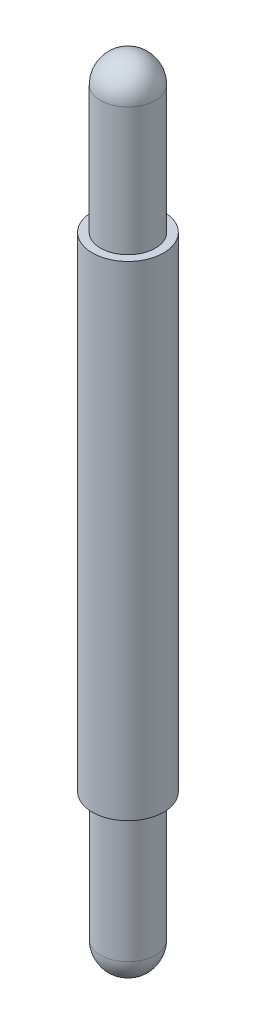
ISO-10303-21;
HEADER;
FILE_DESCRIPTION(('STEP AP214'),'2;1');
FILE_NAME('part.step','',(''),(''),'','','');
FILE_SCHEMA(('AUTOMOTIVE_DESIGN { 1 0 10303 214 1 1 1 1 }'));
ENDSEC;
DATA;
#1=APPLICATION_CONTEXT('core data for automotive mechanical design processes');
#2=APPLICATION_PROTOCOL_DEFINITION('international standard','automotive_design',2000,#1);
#3=PRODUCT_CONTEXT('',#1,'mechanical');
#4=PRODUCT('Part','Part','',(#3));
#5=PRODUCT_RELATED_PRODUCT_CATEGORY('part','',(#4));
#6=PRODUCT_DEFINITION_FORMATION('','',#4);
#7=PRODUCT_DEFINITION_CONTEXT('part definition',#1,'design');
#8=PRODUCT_DEFINITION('design','',#6,#7);
#9=PRODUCT_DEFINITION_SHAPE('','',#8);
#10=(LENGTH_UNIT() NAMED_UNIT(*) SI_UNIT(.MILLI.,.METRE.));
#11=(NAMED_UNIT(*) PLANE_ANGLE_UNIT() SI_UNIT($,.RADIAN.));
#12=(NAMED_UNIT(*) SI_UNIT($,.STERADIAN.) SOLID_ANGLE_UNIT());
#13=UNCERTAINTY_MEASURE_WITH_UNIT(LENGTH_MEASURE(1.E-05),#10,'distance_accuracy_value','');
#14=(GEOMETRIC_REPRESENTATION_CONTEXT(3) GLOBAL_UNCERTAINTY_ASSIGNED_CONTEXT((#13)) GLOBAL_UNIT_ASSIGNED_CONTEXT((#10,
#11,#12)) REPRESENTATION_CONTEXT('',''));
#15=CARTESIAN_POINT('',(0.,0.,0.));
#16=DIRECTION('',(0.,0.,1.));
#17=DIRECTION('',(1.,0.,0.));
#18=AXIS2_PLACEMENT_3D('',#15,#16,#17);
#19=CARTESIAN_POINT('',(0.,29.7499999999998,0.));
#20=DIRECTION('',(0.,1.,0.));
#21=DIRECTION('',(-0.89769110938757,0.,0.440625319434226));
#22=AXIS2_PLACEMENT_3D('',#19,#20,#21);
#23=CYLINDRICAL_SURFACE('',#22,3.);
#24=CARTESIAN_POINT('',(0.,43.7499999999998,0.));
#25=DIRECTION('',(0.,1.,0.));
#26=DIRECTION('',(-0.89769110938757,0.,0.440625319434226));
#27=AXIS2_PLACEMENT_3D('',#24,#25,#26);
#28=CIRCLE('',#27,3.);
#29=CARTESIAN_POINT('',(-2.69307332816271,43.7499999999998,1.32187595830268));
#30=VERTEX_POINT('',#29);
#31=EDGE_CURVE('E9',#30,#30,#28,.F.);
#32=ORIENTED_EDGE('',*,*,#31,.T.);
#33=EDGE_LOOP('',(#32));
#34=FACE_BOUND('',#33,.T.);
#35=CARTESIAN_POINT('',(0.,29.7499999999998,0.));
#36=DIRECTION('',(0.,-1.,0.));
#37=DIRECTION('',(0.89769110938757,0.,-0.440625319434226));
#38=AXIS2_PLACEMENT_3D('',#35,#36,#37);
#39=CIRCLE('',#38,3.);
#40=CARTESIAN_POINT('',(2.69307332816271,29.7499999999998,-1.32187595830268));
#41=VERTEX_POINT('',#40);
#42=EDGE_CURVE('E19',#41,#41,#39,.T.);
#43=ORIENTED_EDGE('',*,*,#42,.F.);
#44=EDGE_LOOP('',(#43));
#45=FACE_BOUND('',#44,.T.);
#46=ADVANCED_FACE('F13',(#34,#45),#23,.T.);
#47=CARTESIAN_POINT('',(0.,43.7499999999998,0.));
#48=DIRECTION('',(0.,-1.,0.));
#49=DIRECTION('',(0.89769110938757,0.,-0.440625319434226));
#50=AXIS2_PLACEMENT_3D('',#47,#48,#49);
#51=SPHERICAL_SURFACE('',#50,3.);
#52=ORIENTED_EDGE('',*,*,#31,.F.);
#53=EDGE_LOOP('',(#52));
#54=FACE_BOUND('',#53,.T.);
#55=ADVANCED_FACE('F44',(#54),#51,.T.);
#56=CARTESIAN_POINT('',(0.,29.7500000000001,0.));
#57=DIRECTION('',(0.,-1.,0.));
#58=DIRECTION('',(0.999589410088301,0.,0.028653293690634));
#59=AXIS2_PLACEMENT_3D('',#56,#57,#58);
#60=PLANE('',#59);
#61=CARTESIAN_POINT('',(0.,29.7500000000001,0.));
#62=DIRECTION('',(0.,-1.,0.));
#63=DIRECTION('',(0.999589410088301,0.,0.028653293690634));
#64=AXIS2_PLACEMENT_3D('',#61,#62,#63);
#65=CIRCLE('',#64,3.9);
#66=CARTESIAN_POINT('',(-3.89839869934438,29.7500000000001,-0.111747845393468));
#67=VERTEX_POINT('',#66);
#68=EDGE_CURVE('E35',#67,#67,#65,.T.);
#69=ORIENTED_EDGE('',*,*,#68,.F.);
#70=EDGE_LOOP('',(#69));
#71=FACE_BOUND('',#70,.T.);
#72=ORIENTED_EDGE('',*,*,#42,.T.);
#73=EDGE_LOOP('',(#72));
#74=FACE_BOUND('',#73,.T.);
#75=ADVANCED_FACE('F41',(#71,#74),#60,.F.);
#76=CARTESIAN_POINT('',(0.,-23.2499999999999,0.));
#77=DIRECTION('',(0.,-1.,0.));
#78=DIRECTION('',(-1.,0.,0.));
#79=AXIS2_PLACEMENT_3D('',#76,#77,#78);
#80=CYLINDRICAL_SURFACE('',#79,3.);
#81=CARTESIAN_POINT('',(0.,-37.2499999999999,0.));
#82=DIRECTION('',(0.,-1.,0.));
#83=DIRECTION('',(-1.,0.,0.));
#84=AXIS2_PLACEMENT_3D('',#81,#82,#83);
#85=CIRCLE('',#84,3.);
#86=CARTESIAN_POINT('',(-3.,-37.2499999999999,0.));
#87=VERTEX_POINT('',#86);
#88=EDGE_CURVE('E23',#87,#87,#85,.F.);
#89=ORIENTED_EDGE('',*,*,#88,.T.);
#90=EDGE_LOOP('',(#89));
#91=FACE_BOUND('',#90,.T.);
#92=CARTESIAN_POINT('',(0.,-23.2499999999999,0.));
#93=DIRECTION('',(0.,1.,0.));
#94=DIRECTION('',(1.,0.,0.));
#95=AXIS2_PLACEMENT_3D('',#92,#93,#94);
#96=CIRCLE('',#95,3.);
#97=CARTESIAN_POINT('',(3.,-23.2499999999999,0.));
#98=VERTEX_POINT('',#97);
#99=EDGE_CURVE('E27',#98,#98,#96,.T.);
#100=ORIENTED_EDGE('',*,*,#99,.F.);
#101=EDGE_LOOP('',(#100));
#102=FACE_BOUND('',#101,.T.);
#103=ADVANCED_FACE('F43',(#91,#102),#80,.T.);
#104=CARTESIAN_POINT('',(0.,-37.2499999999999,0.));
#105=DIRECTION('',(0.,1.,0.));
#106=DIRECTION('',(1.,0.,0.));
#107=AXIS2_PLACEMENT_3D('',#104,#105,#106);
#108=SPHERICAL_SURFACE('',#107,3.);
#109=ORIENTED_EDGE('',*,*,#88,.F.);
#110=EDGE_LOOP('',(#109));
#111=FACE_BOUND('',#110,.T.);
#112=ADVANCED_FACE('F52',(#111),#108,.T.);
#113=CARTESIAN_POINT('',(0.,-23.2499999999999,0.));
#114=DIRECTION('',(0.,-1.,0.));
#115=DIRECTION('',(0.999589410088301,0.,0.028653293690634));
#116=AXIS2_PLACEMENT_3D('',#113,#114,#115);
#117=PLANE('',#116);
#118=CARTESIAN_POINT('',(0.,-23.2499999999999,0.));
#119=DIRECTION('',(0.,-1.,0.));
#120=DIRECTION('',(0.999589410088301,0.,0.028653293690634));
#121=AXIS2_PLACEMENT_3D('',#118,#119,#120);
#122=CIRCLE('',#121,3.9);
#123=CARTESIAN_POINT('',(-3.89839869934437,-23.2499999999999,-0.111747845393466));
#124=VERTEX_POINT('',#123);
#125=EDGE_CURVE('E32',#124,#124,#122,.T.);
#126=ORIENTED_EDGE('',*,*,#125,.T.);
#127=EDGE_LOOP('',(#126));
#128=FACE_BOUND('',#127,.T.);
#129=ORIENTED_EDGE('',*,*,#99,.T.);
#130=EDGE_LOOP('',(#129));
#131=FACE_BOUND('',#130,.T.);
#132=ADVANCED_FACE('F92',(#128,#131),#117,.T.);
#133=CARTESIAN_POINT('',(0.,-23.2499999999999,0.));
#134=DIRECTION('',(0.,1.,0.));
#135=DIRECTION('',(-0.999589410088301,0.,-0.028653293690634));
#136=AXIS2_PLACEMENT_3D('',#133,#134,#135);
#137=CYLINDRICAL_SURFACE('',#136,3.9);
#138=CARTESIAN_POINT('',(-3.89839869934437,-23.2499999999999,-0.111747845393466));
#139=CARTESIAN_POINT('',(-3.89839869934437,-22.6979166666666,-0.111747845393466));
#140=CARTESIAN_POINT('',(-3.89839869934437,-22.1458333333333,-0.111747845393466));
#141=CARTESIAN_POINT('',(-3.89839869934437,-21.0416666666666,-0.111747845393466));
#142=CARTESIAN_POINT('',(-3.89839869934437,-20.4895833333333,-0.111747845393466));
#143=CARTESIAN_POINT('',(-3.89839869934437,-19.3854166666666,-0.111747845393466));
#144=CARTESIAN_POINT('',(-3.89839869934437,-18.8333333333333,-0.111747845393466));
#145=CARTESIAN_POINT('',(-3.89839869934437,-17.7291666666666,-0.111747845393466));
#146=CARTESIAN_POINT('',(-3.89839869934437,-17.1770833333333,-0.111747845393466));
#147=CARTESIAN_POINT('',(-3.89839869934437,-16.0729166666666,-0.111747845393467));
#148=CARTESIAN_POINT('',(-3.89839869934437,-15.5208333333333,-0.111747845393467));
#149=CARTESIAN_POINT('',(-3.89839869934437,-14.4166666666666,-0.111747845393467));
#150=CARTESIAN_POINT('',(-3.89839869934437,-13.8645833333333,-0.111747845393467));
#151=CARTESIAN_POINT('',(-3.89839869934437,-12.7604166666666,-0.111747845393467));
#152=CARTESIAN_POINT('',(-3.89839869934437,-12.2083333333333,-0.111747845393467));
#153=CARTESIAN_POINT('',(-3.89839869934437,-11.1041666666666,-0.111747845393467));
#154=CARTESIAN_POINT('',(-3.89839869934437,-10.5520833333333,-0.111747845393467));
#155=CARTESIAN_POINT('',(-3.89839869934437,-9.44791666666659,-0.111747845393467));
#156=CARTESIAN_POINT('',(-3.89839869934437,-8.89583333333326,-0.111747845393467));
#157=CARTESIAN_POINT('',(-3.89839869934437,-7.79166666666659,-0.111747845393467));
#158=CARTESIAN_POINT('',(-3.89839869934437,-7.23958333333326,-0.111747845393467));
#159=CARTESIAN_POINT('',(-3.89839869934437,-6.13541666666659,-0.111747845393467));
#160=CARTESIAN_POINT('',(-3.89839869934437,-5.58333333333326,-0.111747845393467));
#161=CARTESIAN_POINT('',(-3.89839869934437,-4.47916666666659,-0.111747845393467));
#162=CARTESIAN_POINT('',(-3.89839869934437,-3.92708333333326,-0.111747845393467));
#163=CARTESIAN_POINT('',(-3.89839869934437,-2.82291666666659,-0.111747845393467));
#164=CARTESIAN_POINT('',(-3.89839869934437,-2.27083333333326,-0.111747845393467));
#165=CARTESIAN_POINT('',(-3.89839869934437,-1.1666666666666,-0.111747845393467));
#166=CARTESIAN_POINT('',(-3.89839869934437,-0.614583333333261,-0.111747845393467));
#167=CARTESIAN_POINT('',(-3.89839869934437,0.489583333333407,-0.111747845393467));
#168=CARTESIAN_POINT('',(-3.89839869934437,1.04166666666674,-0.111747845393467));
#169=CARTESIAN_POINT('',(-3.89839869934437,2.14583333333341,-0.111747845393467));
#170=CARTESIAN_POINT('',(-3.89839869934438,2.69791666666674,-0.111747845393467));
#171=CARTESIAN_POINT('',(-3.89839869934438,3.8020833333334,-0.111747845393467));
#172=CARTESIAN_POINT('',(-3.89839869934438,4.35416666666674,-0.111747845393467));
#173=CARTESIAN_POINT('',(-3.89839869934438,5.4583333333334,-0.111747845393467));
#174=CARTESIAN_POINT('',(-3.89839869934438,6.01041666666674,-0.111747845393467));
#175=CARTESIAN_POINT('',(-3.89839869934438,7.11458333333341,-0.111747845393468));
#176=CARTESIAN_POINT('',(-3.89839869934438,7.66666666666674,-0.111747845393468));
#177=CARTESIAN_POINT('',(-3.89839869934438,8.77083333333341,-0.111747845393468));
#178=CARTESIAN_POINT('',(-3.89839869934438,9.32291666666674,-0.111747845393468));
#179=CARTESIAN_POINT('',(-3.89839869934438,10.4270833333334,-0.111747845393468));
#180=CARTESIAN_POINT('',(-3.89839869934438,10.9791666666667,-0.111747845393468));
#181=CARTESIAN_POINT('',(-3.89839869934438,12.0833333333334,-0.111747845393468));
#182=CARTESIAN_POINT('',(-3.89839869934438,12.6354166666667,-0.111747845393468));
#183=CARTESIAN_POINT('',(-3.89839869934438,13.7395833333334,-0.111747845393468));
#184=CARTESIAN_POINT('',(-3.89839869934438,14.2916666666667,-0.111747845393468));
#185=CARTESIAN_POINT('',(-3.89839869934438,15.3958333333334,-0.111747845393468));
#186=CARTESIAN_POINT('',(-3.89839869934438,15.9479166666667,-0.111747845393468));
#187=CARTESIAN_POINT('',(-3.89839869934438,17.0520833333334,-0.111747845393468));
#188=CARTESIAN_POINT('',(-3.89839869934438,17.6041666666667,-0.111747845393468));
#189=CARTESIAN_POINT('',(-3.89839869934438,18.7083333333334,-0.111747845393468));
#190=CARTESIAN_POINT('',(-3.89839869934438,19.2604166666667,-0.111747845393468));
#191=CARTESIAN_POINT('',(-3.89839869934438,20.3645833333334,-0.111747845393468));
#192=CARTESIAN_POINT('',(-3.89839869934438,20.9166666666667,-0.111747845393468));
#193=CARTESIAN_POINT('',(-3.89839869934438,22.0208333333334,-0.111747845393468));
#194=CARTESIAN_POINT('',(-3.89839869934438,22.5729166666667,-0.111747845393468));
#195=CARTESIAN_POINT('',(-3.89839869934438,23.6770833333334,-0.111747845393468));
#196=CARTESIAN_POINT('',(-3.89839869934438,24.2291666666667,-0.111747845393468));
#197=CARTESIAN_POINT('',(-3.89839869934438,25.3333333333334,-0.111747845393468));
#198=CARTESIAN_POINT('',(-3.89839869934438,25.8854166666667,-0.111747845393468));
#199=CARTESIAN_POINT('',(-3.89839869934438,26.9895833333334,-0.111747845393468));
#200=CARTESIAN_POINT('',(-3.89839869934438,27.5416666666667,-0.111747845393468));
#201=CARTESIAN_POINT('',(-3.89839869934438,28.6458333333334,-0.111747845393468));
#202=CARTESIAN_POINT('',(-3.89839869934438,29.1979166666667,-0.111747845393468));
#203=CARTESIAN_POINT('',(-3.89839869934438,29.7500000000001,-0.111747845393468));
#204=B_SPLINE_CURVE_WITH_KNOTS('',3,(#138,#139,#140,#141,#142,#143,#144,#145,#146,#147,#148,
#149,#150,#151,#152,#153,#154,#155,#156,#157,#158,#159,#160,#161,#162,#163,#164,#165,#166,#167,
#168,#169,#170,#171,#172,#173,#174,#175,#176,#177,#178,#179,#180,#181,#182,#183,#184,#185,#186,
#187,#188,#189,#190,#191,#192,#193,#194,#195,#196,#197,#198,#199,#200,#201,#202,#203),
.UNSPECIFIED.,.F.,.F.,(4,2,2,2,2,2,2,2,2,2,2,2,2,2,2,2,2,2,2,2,2,2,2,2,2,2,2,2,2,2,2,2,4),(0.,
1.65625,3.3125,4.96875,6.625,8.28125,9.9375,11.59375,13.25,14.90625,16.5625,18.21875,19.875,
21.53125,23.1875,24.84375,26.5,28.15625,29.8125,31.46875,33.125,34.78125,36.4375,38.09375,39.75,
41.40625,43.0625,44.71875,46.375,48.03125,49.6875,51.34375,53.),.UNSPECIFIED.);
#205=EDGE_CURVE('BSEAM39',#124,#67,#204,.T.);
#206=ORIENTED_EDGE('',*,*,#125,.F.);
#207=ORIENTED_EDGE('',*,*,#68,.T.);
#208=ORIENTED_EDGE('',*,*,#205,.T.);
#209=ORIENTED_EDGE('',*,*,#205,.F.);
#210=EDGE_LOOP('',(#206,#208,#207,#209));
#211=FACE_BOUND('',#210,.T.);
#212=ADVANCED_FACE('F39',(#211),#137,.T.);
#213=CLOSED_SHELL('',(#46,#55,#75,#103,#112,#132,#212));
#214=MANIFOLD_SOLID_BREP('B1',#213);
#215=ADVANCED_BREP_SHAPE_REPRESENTATION('',(#18,#214),#14);
#216=SHAPE_DEFINITION_REPRESENTATION(#9,#215);
ENDSEC;
END-ISO-10303-21;
